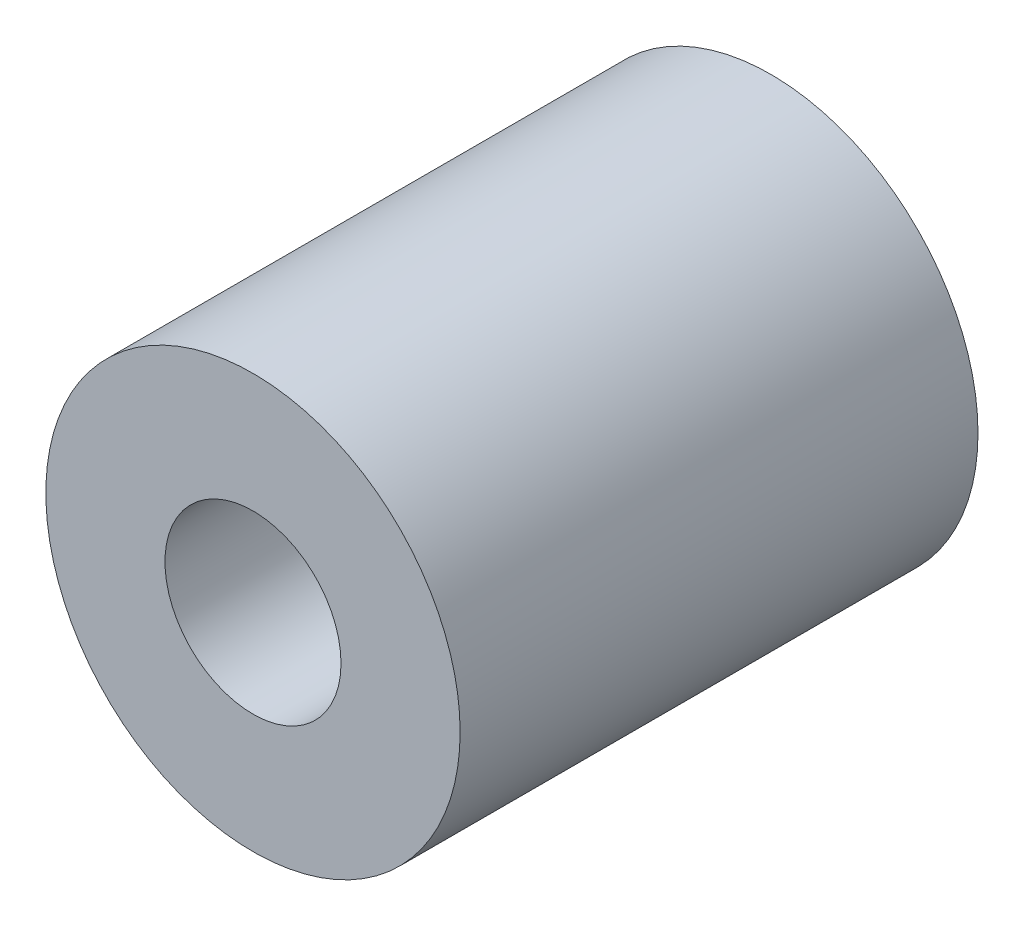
ISO-10303-21;
HEADER;
FILE_DESCRIPTION(('STEP AP214'),'2;1');
FILE_NAME('part.step','',(''),(''),'','','');
FILE_SCHEMA(('AUTOMOTIVE_DESIGN { 1 0 10303 214 1 1 1 1 }'));
ENDSEC;
DATA;
#1=APPLICATION_CONTEXT('core data for automotive mechanical design processes');
#2=APPLICATION_PROTOCOL_DEFINITION('international standard','automotive_design',2000,#1);
#3=PRODUCT_CONTEXT('',#1,'mechanical');
#4=PRODUCT('Part','Part','',(#3));
#5=PRODUCT_RELATED_PRODUCT_CATEGORY('part','',(#4));
#6=PRODUCT_DEFINITION_FORMATION('','',#4);
#7=PRODUCT_DEFINITION_CONTEXT('part definition',#1,'design');
#8=PRODUCT_DEFINITION('design','',#6,#7);
#9=PRODUCT_DEFINITION_SHAPE('','',#8);
#10=(LENGTH_UNIT() NAMED_UNIT(*) SI_UNIT(.MILLI.,.METRE.));
#11=(NAMED_UNIT(*) PLANE_ANGLE_UNIT() SI_UNIT($,.RADIAN.));
#12=(NAMED_UNIT(*) SI_UNIT($,.STERADIAN.) SOLID_ANGLE_UNIT());
#13=UNCERTAINTY_MEASURE_WITH_UNIT(LENGTH_MEASURE(1.E-05),#10,'distance_accuracy_value','');
#14=(GEOMETRIC_REPRESENTATION_CONTEXT(3) GLOBAL_UNCERTAINTY_ASSIGNED_CONTEXT((#13)) GLOBAL_UNIT_ASSIGNED_CONTEXT((#10,
#11,#12)) REPRESENTATION_CONTEXT('',''));
#15=CARTESIAN_POINT('',(0.,0.,0.));
#16=DIRECTION('',(0.,0.,1.));
#17=DIRECTION('',(1.,0.,0.));
#18=AXIS2_PLACEMENT_3D('',#15,#16,#17);
#19=CARTESIAN_POINT('',(0.,0.,10.));
#20=DIRECTION('',(0.,0.,1.));
#21=DIRECTION('',(1.,0.,0.));
#22=AXIS2_PLACEMENT_3D('',#19,#20,#21);
#23=PLANE('',#22);
#24=CARTESIAN_POINT('',(0.,0.,10.));
#25=DIRECTION('',(0.,0.,1.));
#26=DIRECTION('',(1.,0.,0.));
#27=AXIS2_PLACEMENT_3D('',#24,#25,#26);
#28=CIRCLE('',#27,4.);
#29=CARTESIAN_POINT('',(4.,0.,10.));
#30=VERTEX_POINT('',#29);
#31=EDGE_CURVE('E10',#30,#30,#28,.T.);
#32=ORIENTED_EDGE('',*,*,#31,.T.);
#33=EDGE_LOOP('',(#32));
#34=FACE_BOUND('',#33,.T.);
#35=CARTESIAN_POINT('',(0.,0.,10.));
#36=DIRECTION('',(0.,0.,1.));
#37=DIRECTION('',(1.,0.,0.));
#38=AXIS2_PLACEMENT_3D('',#35,#36,#37);
#39=CIRCLE('',#38,1.7);
#40=CARTESIAN_POINT('',(1.7,0.,10.));
#41=VERTEX_POINT('',#40);
#42=EDGE_CURVE('E52',#41,#41,#39,.T.);
#43=ORIENTED_EDGE('',*,*,#42,.F.);
#44=EDGE_LOOP('',(#43));
#45=FACE_BOUND('',#44,.T.);
#46=ADVANCED_FACE('F41',(#34,#45),#23,.T.);
#47=CARTESIAN_POINT('',(0.,0.,0.));
#48=DIRECTION('',(0.,0.,1.));
#49=DIRECTION('',(1.,0.,0.));
#50=AXIS2_PLACEMENT_3D('',#47,#48,#49);
#51=PLANE('',#50);
#52=CARTESIAN_POINT('',(0.,0.,0.));
#53=DIRECTION('',(0.,0.,1.));
#54=DIRECTION('',(1.,0.,0.));
#55=AXIS2_PLACEMENT_3D('',#52,#53,#54);
#56=CIRCLE('',#55,4.);
#57=CARTESIAN_POINT('',(4.,0.,0.));
#58=VERTEX_POINT('',#57);
#59=EDGE_CURVE('E45',#58,#58,#56,.T.);
#60=ORIENTED_EDGE('',*,*,#59,.F.);
#61=EDGE_LOOP('',(#60));
#62=FACE_BOUND('',#61,.T.);
#63=CARTESIAN_POINT('',(0.,0.,0.));
#64=DIRECTION('',(0.,0.,1.));
#65=DIRECTION('',(1.,0.,0.));
#66=AXIS2_PLACEMENT_3D('',#63,#64,#65);
#67=CIRCLE('',#66,1.7);
#68=CARTESIAN_POINT('',(1.7,0.,0.));
#69=VERTEX_POINT('',#68);
#70=EDGE_CURVE('E54',#69,#69,#67,.T.);
#71=ORIENTED_EDGE('',*,*,#70,.T.);
#72=EDGE_LOOP('',(#71));
#73=FACE_BOUND('',#72,.T.);
#74=ADVANCED_FACE('F64',(#62,#73),#51,.F.);
#75=CARTESIAN_POINT('',(0.,0.,10.));
#76=DIRECTION('',(0.,0.,-1.));
#77=DIRECTION('',(-1.,0.,0.));
#78=AXIS2_PLACEMENT_3D('',#75,#76,#77);
#79=CYLINDRICAL_SURFACE('',#78,4.);
#80=ORIENTED_EDGE('',*,*,#31,.F.);
#81=EDGE_LOOP('',(#80));
#82=FACE_BOUND('',#81,.T.);
#83=ORIENTED_EDGE('',*,*,#59,.T.);
#84=EDGE_LOOP('',(#83));
#85=FACE_BOUND('',#84,.T.);
#86=ADVANCED_FACE('F43',(#82,#85),#79,.T.);
#87=CARTESIAN_POINT('',(0.,0.,10.));
#88=DIRECTION('',(0.,0.,-1.));
#89=DIRECTION('',(-1.,0.,0.));
#90=AXIS2_PLACEMENT_3D('',#87,#88,#89);
#91=CYLINDRICAL_SURFACE('',#90,1.7);
#92=ORIENTED_EDGE('',*,*,#42,.T.);
#93=EDGE_LOOP('',(#92));
#94=FACE_BOUND('',#93,.T.);
#95=ORIENTED_EDGE('',*,*,#70,.F.);
#96=EDGE_LOOP('',(#95));
#97=FACE_BOUND('',#96,.T.);
#98=ADVANCED_FACE('F60',(#94,#97),#91,.F.);
#99=CLOSED_SHELL('',(#46,#74,#86,#98));
#100=MANIFOLD_SOLID_BREP('B2',#99);
#101=ADVANCED_BREP_SHAPE_REPRESENTATION('',(#18,#100),#14);
#102=SHAPE_DEFINITION_REPRESENTATION(#9,#101);
ENDSEC;
END-ISO-10303-21;
